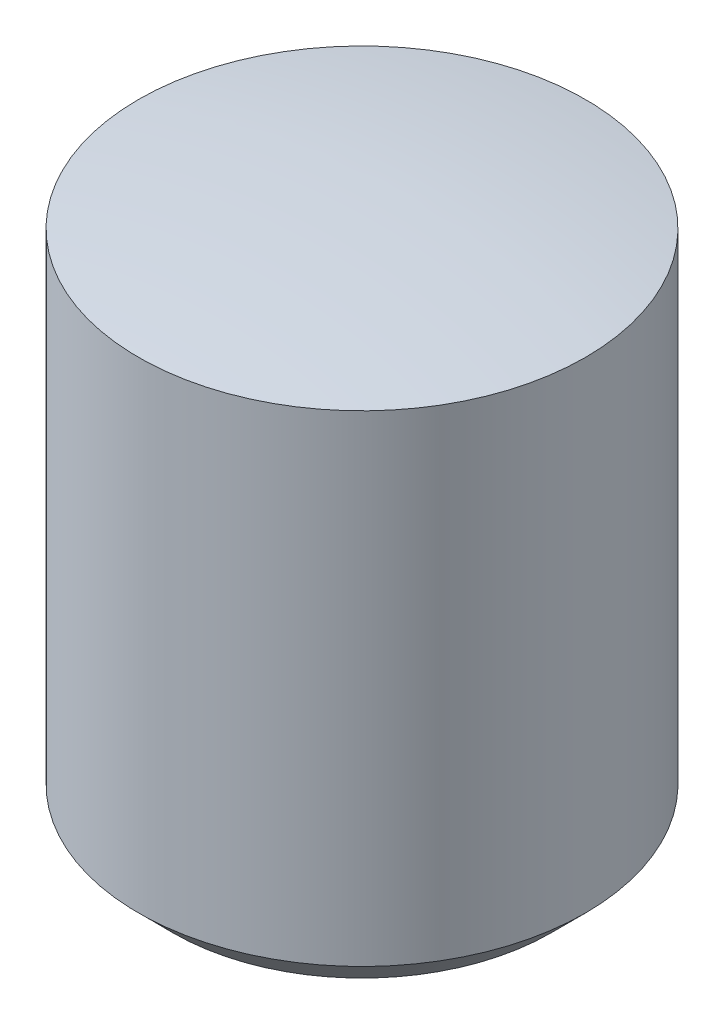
ISO-10303-21;
HEADER;
FILE_DESCRIPTION(('STEP AP214'),'2;1');
FILE_NAME('part.step','',(''),(''),'','','');
FILE_SCHEMA(('AUTOMOTIVE_DESIGN { 1 0 10303 214 1 1 1 1 }'));
ENDSEC;
DATA;
#1=APPLICATION_CONTEXT('core data for automotive mechanical design processes');
#2=APPLICATION_PROTOCOL_DEFINITION('international standard','automotive_design',2000,#1);
#3=PRODUCT_CONTEXT('',#1,'mechanical');
#4=PRODUCT('Part','Part','',(#3));
#5=PRODUCT_RELATED_PRODUCT_CATEGORY('part','',(#4));
#6=PRODUCT_DEFINITION_FORMATION('','',#4);
#7=PRODUCT_DEFINITION_CONTEXT('part definition',#1,'design');
#8=PRODUCT_DEFINITION('design','',#6,#7);
#9=PRODUCT_DEFINITION_SHAPE('','',#8);
#10=(LENGTH_UNIT() NAMED_UNIT(*) SI_UNIT(.MILLI.,.METRE.));
#11=(NAMED_UNIT(*) PLANE_ANGLE_UNIT() SI_UNIT($,.RADIAN.));
#12=(NAMED_UNIT(*) SI_UNIT($,.STERADIAN.) SOLID_ANGLE_UNIT());
#13=UNCERTAINTY_MEASURE_WITH_UNIT(LENGTH_MEASURE(1.E-05),#10,'distance_accuracy_value','');
#14=(GEOMETRIC_REPRESENTATION_CONTEXT(3) GLOBAL_UNCERTAINTY_ASSIGNED_CONTEXT((#13)) GLOBAL_UNIT_ASSIGNED_CONTEXT((#10,
#11,#12)) REPRESENTATION_CONTEXT('',''));
#15=CARTESIAN_POINT('',(0.,0.,0.));
#16=DIRECTION('',(0.,0.,1.));
#17=DIRECTION('',(1.,0.,0.));
#18=AXIS2_PLACEMENT_3D('',#15,#16,#17);
#19=CARTESIAN_POINT('',(0.,0.,0.));
#20=DIRECTION('',(0.,1.,0.));
#21=DIRECTION('',(-1.,0.,0.));
#22=AXIS2_PLACEMENT_3D('',#19,#20,#21);
#23=PLANE('',#22);
#24=CARTESIAN_POINT('',(0.,0.,0.));
#25=DIRECTION('',(0.,1.,0.));
#26=DIRECTION('',(-1.,0.,0.));
#27=AXIS2_PLACEMENT_3D('',#24,#25,#26);
#28=CIRCLE('',#27,5.5);
#29=CARTESIAN_POINT('',(-5.5,0.,0.));
#30=VERTEX_POINT('',#29);
#31=EDGE_CURVE('E56',#30,#30,#28,.F.);
#32=ORIENTED_EDGE('',*,*,#31,.T.);
#33=EDGE_LOOP('',(#32));
#34=FACE_BOUND('',#33,.T.);
#35=CARTESIAN_POINT('',(0.,0.,0.));
#36=DIRECTION('',(0.,-1.,0.));
#37=DIRECTION('',(0.,0.,-1.));
#38=AXIS2_PLACEMENT_3D('',#35,#36,#37);
#39=CIRCLE('',#38,2.49999999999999);
#40=CARTESIAN_POINT('',(0.,0.,-2.49999999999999));
#41=VERTEX_POINT('',#40);
#42=EDGE_CURVE('E70',#41,#41,#39,.T.);
#43=ORIENTED_EDGE('',*,*,#42,.F.);
#44=EDGE_LOOP('',(#43));
#45=FACE_BOUND('',#44,.T.);
#46=ADVANCED_FACE('F49',(#34,#45),#23,.F.);
#47=CARTESIAN_POINT('',(0.,-27.,0.));
#48=DIRECTION('',(0.,-1.,0.));
#49=DIRECTION('',(-1.,0.,0.));
#50=AXIS2_PLACEMENT_3D('',#47,#48,#49);
#51=SPHERICAL_SURFACE('',#50,42.5000000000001);
#52=CARTESIAN_POINT('',(0.,15.,0.));
#53=DIRECTION('',(0.,-1.,0.));
#54=DIRECTION('',(1.,0.,0.));
#55=AXIS2_PLACEMENT_3D('',#52,#53,#54);
#56=CIRCLE('',#55,6.5);
#57=CARTESIAN_POINT('',(6.50000000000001,15.,0.));
#58=VERTEX_POINT('',#57);
#59=EDGE_CURVE('E69',#58,#58,#56,.T.);
#60=ORIENTED_EDGE('',*,*,#59,.F.);
#61=EDGE_LOOP('',(#60));
#62=FACE_BOUND('',#61,.T.);
#63=ADVANCED_FACE('F89',(#62),#51,.T.);
#64=CARTESIAN_POINT('',(0.,0.,0.));
#65=DIRECTION('',(0.,-1.,0.));
#66=DIRECTION('',(1.,0.,0.));
#67=AXIS2_PLACEMENT_3D('',#64,#65,#66);
#68=CYLINDRICAL_SURFACE('',#67,6.5);
#69=CARTESIAN_POINT('',(0.,1.00000000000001,0.));
#70=DIRECTION('',(0.,1.,0.));
#71=DIRECTION('',(-1.,0.,0.));
#72=AXIS2_PLACEMENT_3D('',#69,#70,#71);
#73=CIRCLE('',#72,6.5);
#74=CARTESIAN_POINT('',(-6.5,1.00000000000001,0.));
#75=VERTEX_POINT('',#74);
#76=EDGE_CURVE('E13',#75,#75,#73,.T.);
#77=ORIENTED_EDGE('',*,*,#76,.T.);
#78=EDGE_LOOP('',(#77));
#79=FACE_BOUND('',#78,.T.);
#80=ORIENTED_EDGE('',*,*,#59,.T.);
#81=EDGE_LOOP('',(#80));
#82=FACE_BOUND('',#81,.T.);
#83=ADVANCED_FACE('F63',(#79,#82),#68,.T.);
#84=CARTESIAN_POINT('',(0.,12.,0.));
#85=DIRECTION('',(0.,-1.,0.));
#86=DIRECTION('',(0.,0.,-1.));
#87=AXIS2_PLACEMENT_3D('',#84,#85,#86);
#88=CONICAL_SURFACE('',#87,2.5,1.02974425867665);
#89=CARTESIAN_POINT('',(0.,13.5021515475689,0.));
#90=VERTEX_POINT('',#89);
#91=VERTEX_LOOP('',#90);
#92=FACE_BOUND('',#91,.T.);
#93=CARTESIAN_POINT('',(0.,12.,0.));
#94=DIRECTION('',(0.,-1.,0.));
#95=DIRECTION('',(0.,0.,-1.));
#96=AXIS2_PLACEMENT_3D('',#93,#94,#95);
#97=CIRCLE('',#96,2.5);
#98=CARTESIAN_POINT('',(0.,12.,-2.5));
#99=VERTEX_POINT('',#98);
#100=EDGE_CURVE('E67',#99,#99,#97,.T.);
#101=ORIENTED_EDGE('',*,*,#100,.T.);
#102=EDGE_LOOP('',(#101));
#103=FACE_BOUND('',#102,.T.);
#104=ADVANCED_FACE('F59',(#92,#103),#88,.F.);
#105=CARTESIAN_POINT('',(0.,0.,0.));
#106=DIRECTION('',(0.,-1.,0.));
#107=DIRECTION('',(0.,0.,-1.));
#108=AXIS2_PLACEMENT_3D('',#105,#106,#107);
#109=CYLINDRICAL_SURFACE('',#108,2.49999999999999);
#110=ORIENTED_EDGE('',*,*,#100,.F.);
#111=EDGE_LOOP('',(#110));
#112=FACE_BOUND('',#111,.T.);
#113=ORIENTED_EDGE('',*,*,#42,.T.);
#114=EDGE_LOOP('',(#113));
#115=FACE_BOUND('',#114,.T.);
#116=ADVANCED_FACE('F62',(#112,#115),#109,.F.);
#117=CARTESIAN_POINT('',(0.,0.,0.));
#118=DIRECTION('',(0.,1.,0.));
#119=DIRECTION('',(-1.,0.,0.));
#120=AXIS2_PLACEMENT_3D('',#117,#118,#119);
#121=CONICAL_SURFACE('',#120,5.5,0.785398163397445);
#122=ORIENTED_EDGE('',*,*,#76,.F.);
#123=EDGE_LOOP('',(#122));
#124=FACE_BOUND('',#123,.T.);
#125=ORIENTED_EDGE('',*,*,#31,.F.);
#126=EDGE_LOOP('',(#125));
#127=FACE_BOUND('',#126,.T.);
#128=ADVANCED_FACE('F51',(#124,#127),#121,.T.);
#129=CLOSED_SHELL('',(#46,#63,#83,#104,#116,#128));
#130=MANIFOLD_SOLID_BREP('B2',#129);
#131=ADVANCED_BREP_SHAPE_REPRESENTATION('',(#18,#130),#14);
#132=SHAPE_DEFINITION_REPRESENTATION(#9,#131);
ENDSEC;
END-ISO-10303-21;
